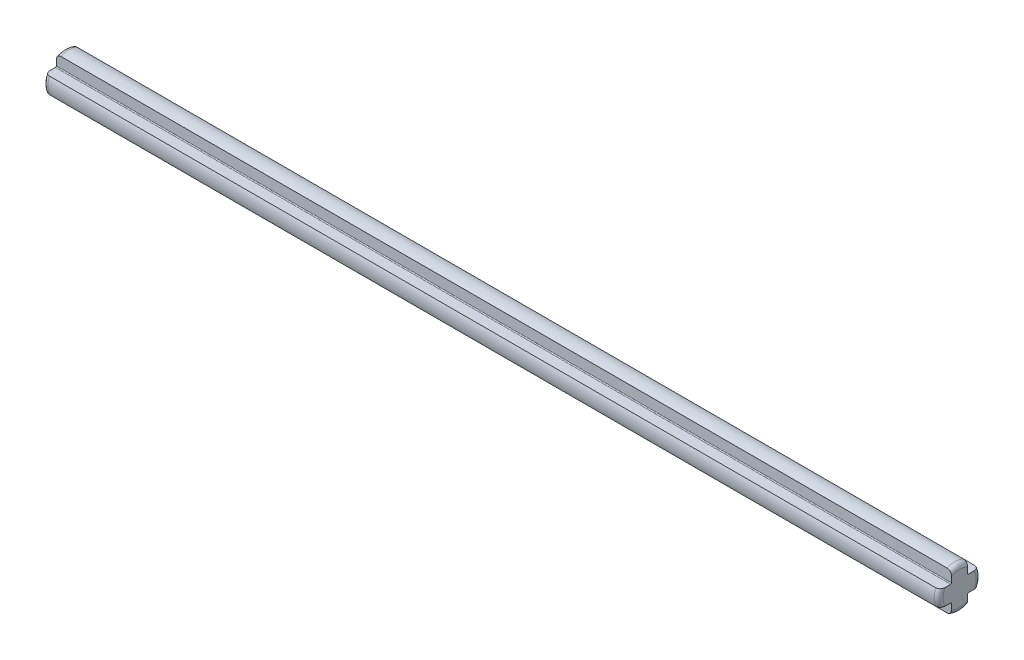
from build123d import *

# Parameters (mm, degrees)
EXTRUIR1_DEPTH = 50
REDONDEO1_R    = 0.5


with BuildPart() as part:
    # Croquis1 → Extruir1 (new, symmetric)
    with BuildSketch(Plane(origin=(0, 0, 0), x_dir=(0, 0, -1), z_dir=(1, 0, 0))):
        with BuildLine():
            Line((-0.9, 2.170829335), (-0.9, 1))
            ThreePointArc((-0.9, 1), (-0.929289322, 0.929289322), (-1, 0.9))
            Line((-1, 0.9), (-2.170829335, 0.9))
            ThreePointArc((-2.170829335, 0.9), (-2.35, 0), (-2.170829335, -0.9))
            Line((-2.170829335, -0.9), (-1, -0.9))
            ThreePointArc((-1, -0.9), (-0.929289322, -0.929289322), (-0.9, -1))
            Line((-0.9, -1), (-0.9, -2.170829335))
            ThreePointArc((-0.9, -2.170829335), (0, -2.35), (0.9, -2.170829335))
            Line((0.9, -2.170829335), (0.9, -1))
            ThreePointArc((0.9, -1), (0.929289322, -0.929289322), (1, -0.9))
            Line((1, -0.9), (2.170829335, -0.9))
            ThreePointArc((2.170829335, -0.9), (2.35, 0), (2.170829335, 0.9))
            Line((2.170829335, 0.9), (1, 0.9))
            ThreePointArc((1, 0.9), (0.929289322, 0.929289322), (0.9, 1))
            Line((0.9, 1), (0.9, 2.170829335))
            ThreePointArc((0.9, 2.170829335), (0, 2.35), (-0.9, 2.170829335))
        make_face()
    extrude(amount=EXTRUIR1_DEPTH, both=True)

    # Redondeo1
    redondeo1_edges = [part.edges().sort_by_distance(p)[0] for p in [
        (-50, 2.35, 0),
        (50, -2.35, 0),
        (-50, 0, -2.35),
        (-50, -2.35, 0),
        (-50, 0, 2.35),
        (50, 0, -2.35),
        (50, 0, 2.35),
        (50, 2.35, 0),
    ]]
    fillet(redondeo1_edges, radius=REDONDEO1_R)


solid = part.part
